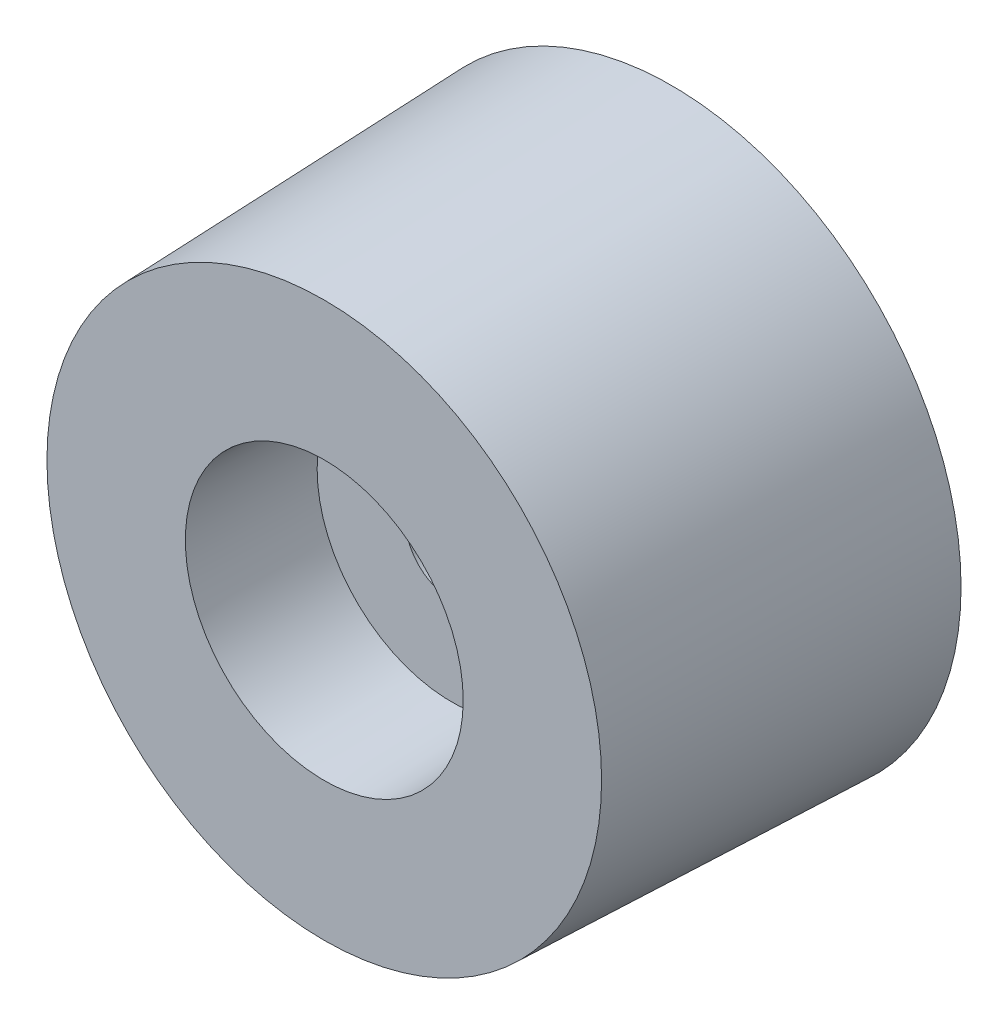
from build123d import *

# Parameters (mm, degrees)
ESQUISSE1_R             = 12.5
BASEEXTRUSION_DEPTH     = 15
BASEEXTRUSION_TAPER     = 1.999999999
ESQUISSE2_R             = 6
COUPER_EXTRUSION1_DEPTH = 5.5
COUPER_EXTRUSION1_DRAFT = -1.999999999
ESQUISSE3_R             = 2
COUPER_EXTRUSION2_DEPTH = 21.06863224


with BuildPart() as part:
    # Esquisse1 → BaseExtrusion (new body)
    with BuildSketch(Plane.XY):
        Circle(ESQUISSE1_R)
    extrude(amount=BASEEXTRUSION_DEPTH, taper=BASEEXTRUSION_TAPER)


with BuildPart() as couper_extrusion1_tool:
    # Esquisse2 → Couper-Extrusion1 (with draft: the straight prism first)
    with BuildSketch(Plane.XY.offset(15)):
        Circle(ESQUISSE2_R)
    extrude(amount=-COUPER_EXTRUSION1_DEPTH)
    # Couper-Extrusion1: the draft: its side faces are tilted about the plane it starts from
    couper_extrusion1_sides = [couper_extrusion1_tool.faces().sort_by_distance(p)[0] for p in [
        (-6, 0, 12.25),
    ]]
    draft(couper_extrusion1_sides, Plane.XY.offset(15), COUPER_EXTRUSION1_DRAFT)


with BuildPart() as part_1:
    add(part.part)

    # Couper-Extrusion1: cut by couper_extrusion1_tool
    add(couper_extrusion1_tool.part, mode=Mode.SUBTRACT)

    # Esquisse3 → Couper-Extrusion2 (cut, through all)
    with BuildSketch(Plane.XY.offset(9.5)):
        Circle(ESQUISSE3_R)
    extrude(amount=-COUPER_EXTRUSION2_DEPTH, mode=Mode.SUBTRACT)


solid = part_1.part
